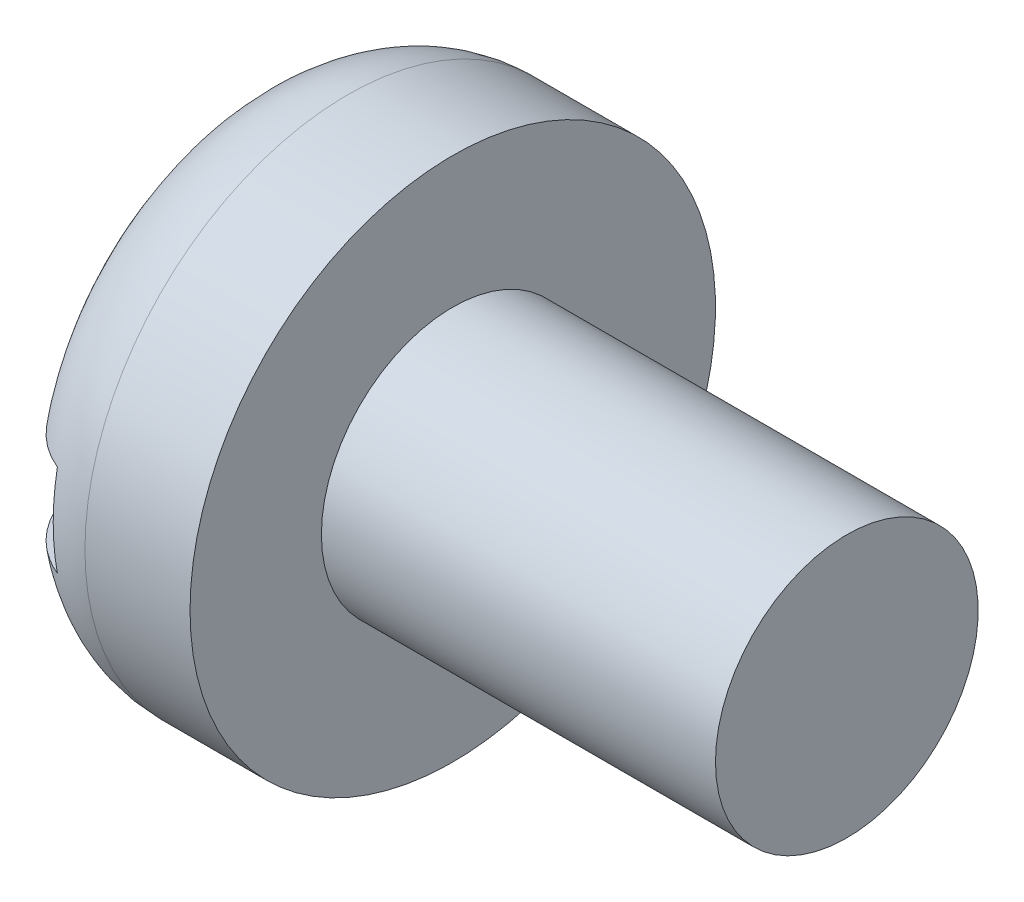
from build123d import *

# Parameters (mm, degrees)
SKETCH2_W  = 4
SKETCH2_H  = 0.7
SLOT_DEPTH = 0.5


with BuildPart() as part:
    # BodySke → Base-Revolve (revolve)
    with BuildSketch(Plane.XY, mode=Mode.PRIVATE) as base_revolve_sk:
        with BuildLine():
            Line((1.6, 1), (1.6, 2))
            Line((1.6, 2), (0.8, 2))
            ThreePointArc((0.8, 2), (0.234314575, 1.765685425), (0, 1.2))
            Line((0, 1.2), (0, 0))
            Line((0, 0), (4.6, 0))
            Line((4.6, 0), (4.6, 1))
            Line((4.6, 1), (1.6, 1))
        make_face()
    revolve(base_revolve_sk.sketch.rotate(Axis((-25.4, 0, 0), (1, 0, 0)), 90), axis=Axis((-25.4, 0, 0), (1, 0, 0)))

    # Sketch2 → Slot (cut)
    with BuildSketch(Plane(origin=(0, 0, 0), x_dir=(0, 0, -1), z_dir=(1, 0, 0))):
        Rectangle(SKETCH2_W, SKETCH2_H)
    extrude(amount=SLOT_DEPTH, mode=Mode.SUBTRACT)


solid = part.part
